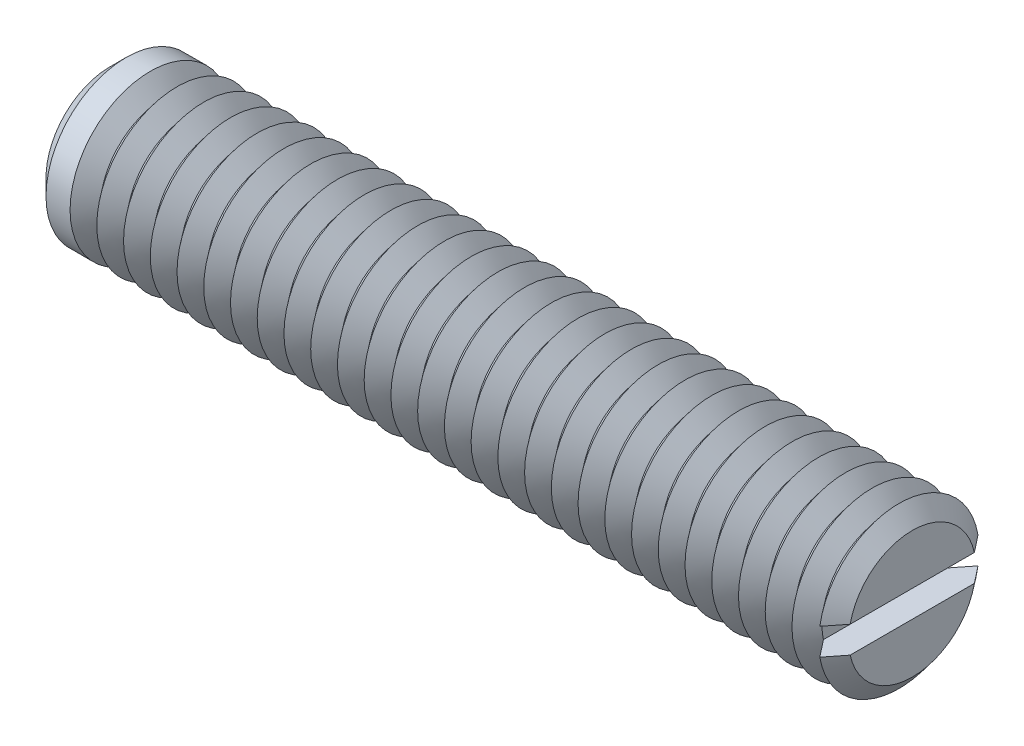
from build123d import *

# Parameters (mm, degrees)
SKETCH1_R       = 3
EXTRUDE1_DEPTH  = 15
SKETCH2_W       = 1
SKETCH2_H       = 1
EXTRUDE2_DEPTH  = 4.5
CHAMFER1_SIZE   = 0.6
LPATTERN1_COUNT = 29
LPATTERN1_PITCH = 1


with BuildPart() as part:
    # Sketch1 → Extrude1 (new, symmetric)
    with BuildSketch(Plane(origin=(0, 0, 0), x_dir=(0, 0, -1), z_dir=(1, 0, 0))):
        Circle(SKETCH1_R)
    extrude(amount=EXTRUDE1_DEPTH, both=True)

    # Sketch2 → Extrude2 (cut, symmetric)
    with BuildSketch(Plane.XY):
        with Locations((14.5, 0)):
            Rectangle(SKETCH2_W, SKETCH2_H)
    extrude(amount=EXTRUDE2_DEPTH, both=True, mode=Mode.SUBTRACT)

    # Chamfer1
    chamfer1_edges = [part.edges().sort_by_distance(p)[0] for p in [
        (-15, 0, 3),
    ]]
    chamfer(chamfer1_edges, length=CHAMFER1_SIZE)

    # Sketch3 → Cut-Revolve1 (revolve, cut)
    with BuildSketch(Plane.XY, mode=Mode.PRIVATE) as cut_revolve1_sk:
        Polygon((14.5, -3), (15.5, -3), (15, -2.3755002), align=None)
    cut_revolve1 = revolve(cut_revolve1_sk.sketch.rotate(Axis((0, 0, 0), (1, 0, 0)), 260.405931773), axis=Axis((0, 0, 0), (1, 0, 0)), mode=Mode.SUBTRACT)

    # LPattern1: Cut-Revolve1 ×29
    with Locations(*[(-i * LPATTERN1_PITCH, 0, 0) for i in range(1, LPATTERN1_COUNT)]):
        add(cut_revolve1, mode=Mode.SUBTRACT)


solid = part.part
